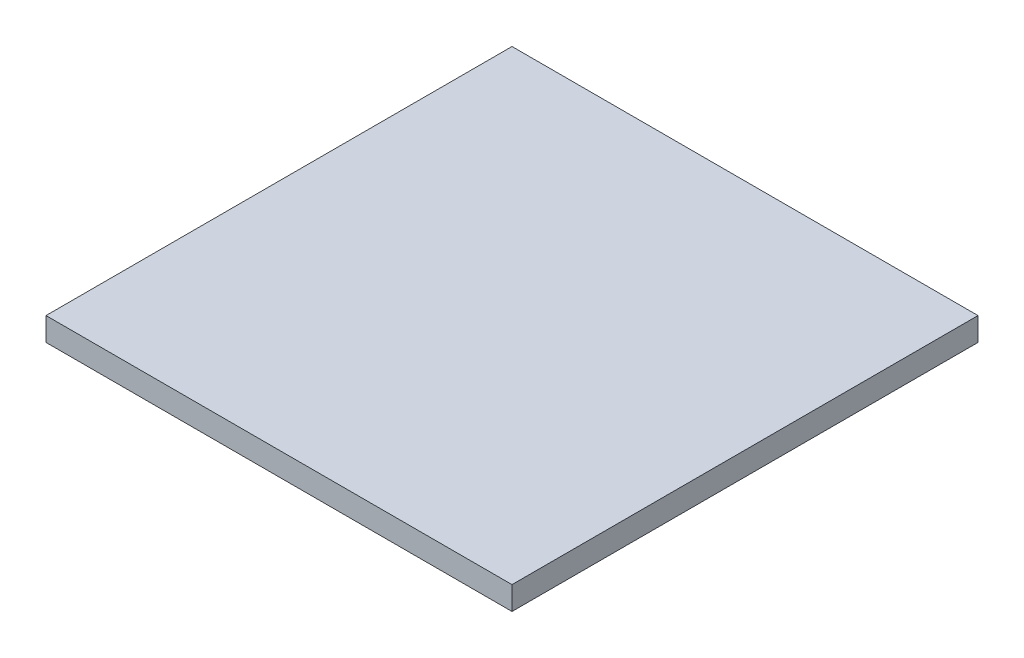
from build123d import *

# Parameters (mm, degrees)
ESQUISSE1_W      = 600
ESQUISSE1_H      = 600
EXTRUSION1_DEPTH = 30


with BuildPart() as part:
    # Esquisse1 → Extrusion1 (new body)
    with BuildSketch(Plane(origin=(0, 0, 0), x_dir=(1, 0, 0), z_dir=(0, 1, 0))):
        with Locations((300, 300)):
            Rectangle(ESQUISSE1_W, ESQUISSE1_H)
    extrude(amount=EXTRUSION1_DEPTH)


solid = part.part
